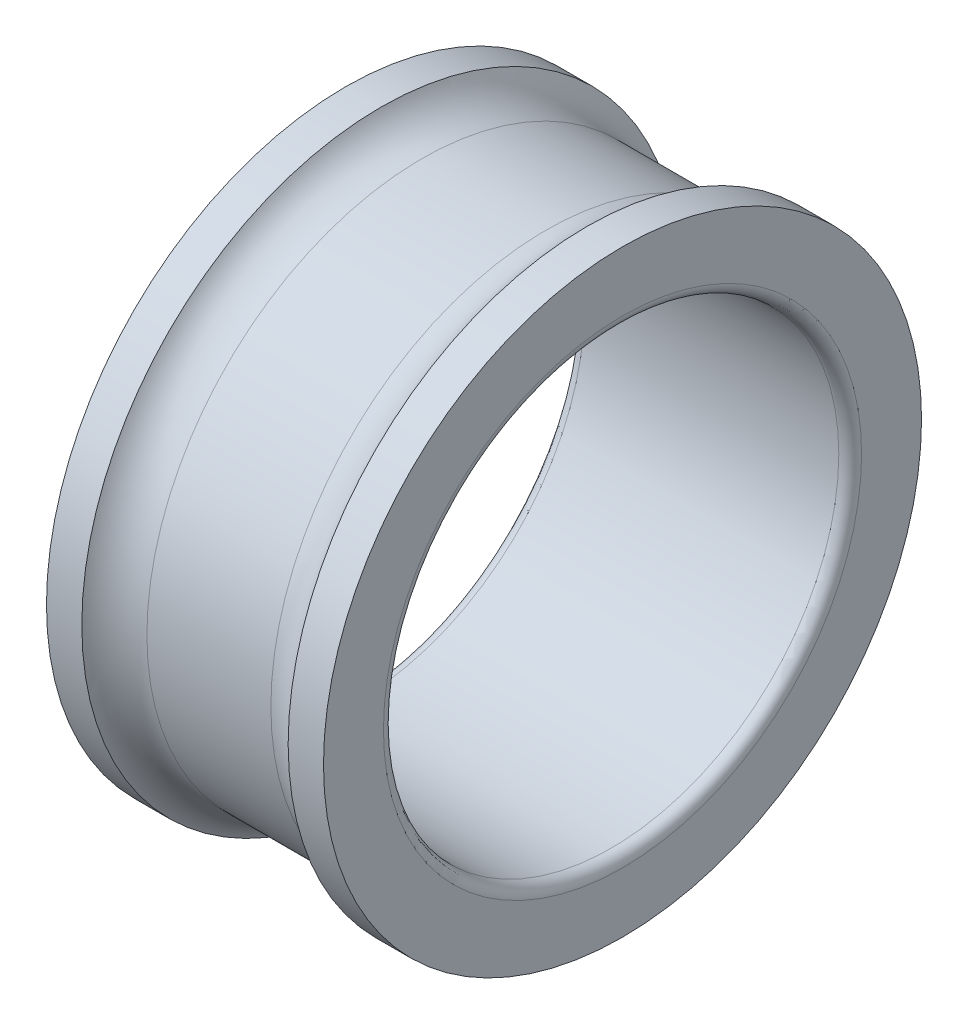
from build123d import *


with BuildPart() as part:
    # Esquisse1 → R_volution1 (revolve)
    with BuildSketch(Plane.XY, mode=Mode.PRIVATE) as r_volution1_sk:
        with BuildLine():
            Line((-16.75, 30), (16.75, 30))
            ThreePointArc((16.75, 30), (17.810660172, 30.439339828), (18.25, 31.5))
            Line((18.25, 31.5), (18.25, 39.4))
            Line((18.25, 39.4), (13.593682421, 39.4))
            ThreePointArc((13.593682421, 39.4), (11.304141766, 37.094562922), (8.166666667, 36.25))
            Line((8.166666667, 36.25), (-8.166666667, 36.25))
            ThreePointArc((-8.166666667, 36.25), (-11.304141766, 37.094562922), (-13.593682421, 39.4))
            Line((-13.593682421, 39.4), (-18.25, 39.4))
            Line((-18.25, 39.4), (-18.25, 31.5))
            ThreePointArc((-18.25, 31.5), (-17.810660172, 30.439339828), (-16.75, 30))
        make_face()
    revolve(r_volution1_sk.sketch.rotate(Axis((0, 0, 0), (1, 0, 0)), 90), axis=Axis((0, 0, 0), (1, 0, 0)))


solid = part.part
